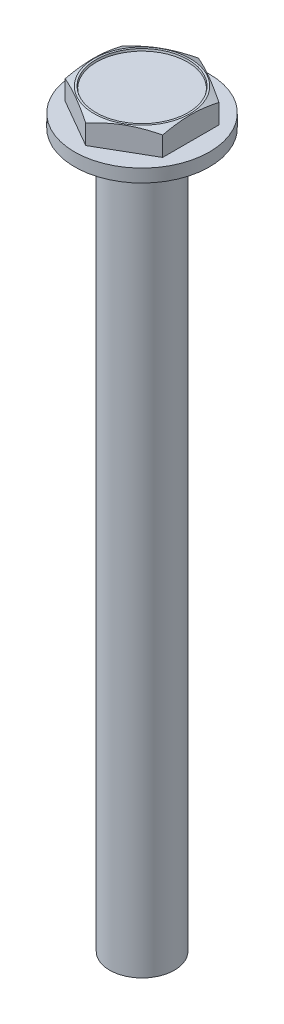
from build123d import *

# Parameters (mm, degrees)
SKETCH2_W          = 1.587498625
SKETCH2_H          = 34.925
SKETCH3_W          = 7.264393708
SKETCH3_H          = 7.264393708
CUT_EXTRUDE1_DEPTH = 1.14299901


with BuildPart() as part:
    # Sketch1 → Base-Revolve (revolve)
    with BuildSketch(Plane.XY, mode=Mode.PRIVATE) as base_revolve_sk:
        Polygon((0, 0), (3.30199714, 0), (3.30199714, 1.332469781), (2.346557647, 1.77799846), (2.252695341, 1.77799846), (2.229229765, 1.684136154), (0, 1.684136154), align=None)
    revolve(base_revolve_sk.sketch.rotate(Axis((0, 0, 0), (0, 1, 0)), 90), axis=Axis((0, 0, 0), (0, 1, 0)))

    # Sketch2 → Boss-Revolve1 (revolve)
    with BuildSketch(Plane.XY, mode=Mode.PRIVATE) as boss_revolve1_sk:
        with Locations((0.793749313, -17.4625)):
            Rectangle(SKETCH2_W, SKETCH2_H)
    revolve(boss_revolve1_sk.sketch.rotate(Axis((0, 0, 0), (0, 1, 0)), 90), axis=Axis((0, 0, 0), (0, 1, 0)))

    # Sketch3 → Cut-Extrude1 (cut)
    with BuildSketch(Plane(origin=(0, 1.77799846, 0), x_dir=(-1, 0, 0), z_dir=(0, 1, 0))):
        Rectangle(SKETCH3_W, SKETCH3_H)
        Polygon((2.387597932, 1.378480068), (6.25e-07, 2.756960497), (-2.387597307, 1.378481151), (-2.387598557, -1.378478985), (-1.876e-06, -2.756960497), (2.387596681, -1.378482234), align=None, mode=Mode.SUBTRACT)
    extrude(amount=-CUT_EXTRUDE1_DEPTH, mode=Mode.SUBTRACT)


solid = part.part
